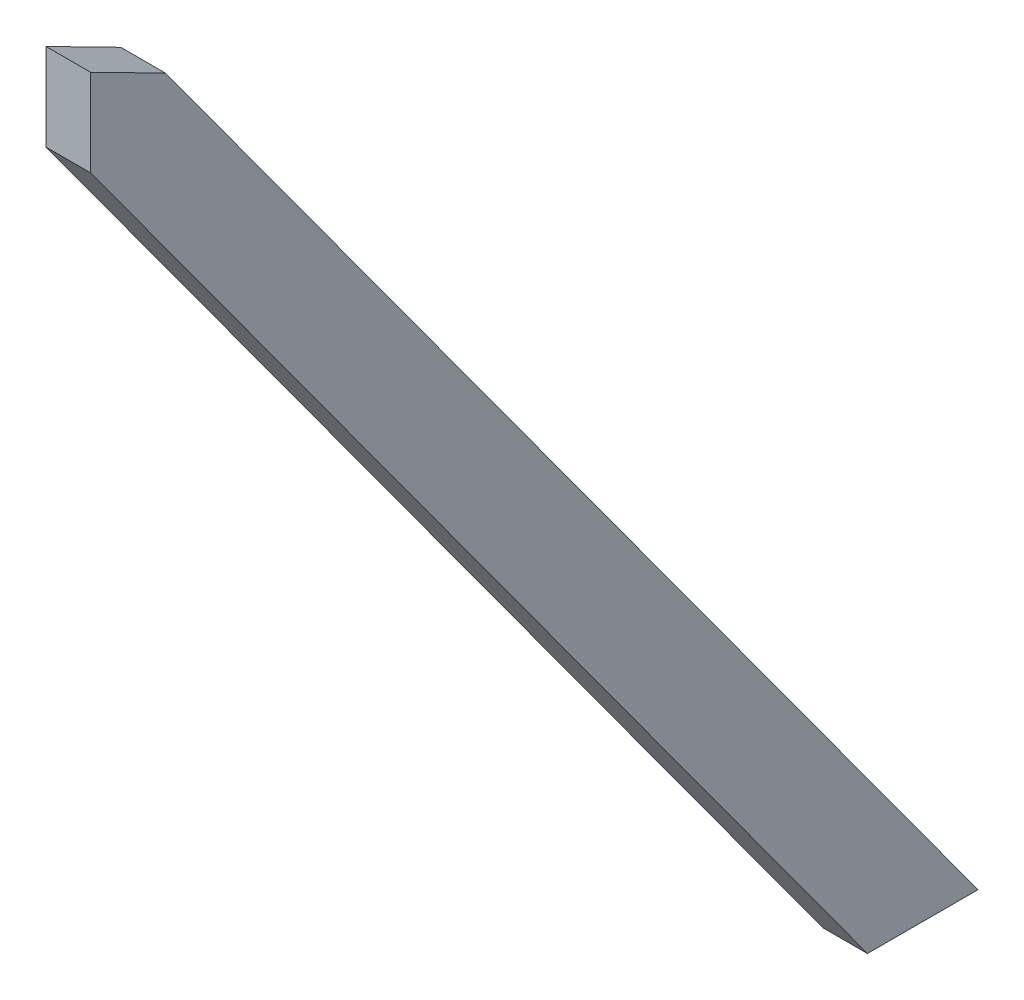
ISO-10303-21;
HEADER;
FILE_DESCRIPTION(('STEP AP214'),'2;1');
FILE_NAME('part.step','',(''),(''),'','','');
FILE_SCHEMA(('AUTOMOTIVE_DESIGN { 1 0 10303 214 1 1 1 1 }'));
ENDSEC;
DATA;
#1=APPLICATION_CONTEXT('core data for automotive mechanical design processes');
#2=APPLICATION_PROTOCOL_DEFINITION('international standard','automotive_design',2000,#1);
#3=PRODUCT_CONTEXT('',#1,'mechanical');
#4=PRODUCT('Part','Part','',(#3));
#5=PRODUCT_RELATED_PRODUCT_CATEGORY('part','',(#4));
#6=PRODUCT_DEFINITION_FORMATION('','',#4);
#7=PRODUCT_DEFINITION_CONTEXT('part definition',#1,'design');
#8=PRODUCT_DEFINITION('design','',#6,#7);
#9=PRODUCT_DEFINITION_SHAPE('','',#8);
#10=(LENGTH_UNIT() NAMED_UNIT(*) SI_UNIT(.MILLI.,.METRE.));
#11=(NAMED_UNIT(*) PLANE_ANGLE_UNIT() SI_UNIT($,.RADIAN.));
#12=(NAMED_UNIT(*) SI_UNIT($,.STERADIAN.) SOLID_ANGLE_UNIT());
#13=UNCERTAINTY_MEASURE_WITH_UNIT(LENGTH_MEASURE(1.E-05),#10,'distance_accuracy_value','');
#14=(GEOMETRIC_REPRESENTATION_CONTEXT(3) GLOBAL_UNCERTAINTY_ASSIGNED_CONTEXT((#13)) GLOBAL_UNIT_ASSIGNED_CONTEXT((#10,
#11,#12)) REPRESENTATION_CONTEXT('',''));
#15=CARTESIAN_POINT('',(0.,0.,0.));
#16=DIRECTION('',(0.,0.,1.));
#17=DIRECTION('',(1.,0.,0.));
#18=AXIS2_PLACEMENT_3D('',#15,#16,#17);
#19=CARTESIAN_POINT('',(5.,-68.3646212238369,-37.1411440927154));
#20=DIRECTION('',(0.,1.,0.));
#21=DIRECTION('',(0.,0.,1.));
#22=AXIS2_PLACEMENT_3D('',#19,#20,#21);
#23=PLANE('',#22);
#24=DIRECTION('',(0.,0.,-1.));
#25=VECTOR('',#24,1.);
#26=CARTESIAN_POINT('',(0.,-68.3646212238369,-37.1411440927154));
#27=LINE('',#26,#25);
#28=CARTESIAN_POINT('',(0.,-68.3646212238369,-37.1411440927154));
#29=VERTEX_POINT('',#28);
#30=CARTESIAN_POINT('',(0.,-68.3646212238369,-49.5206885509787));
#31=VERTEX_POINT('',#30);
#32=EDGE_CURVE('E78',#29,#31,#27,.T.);
#33=ORIENTED_EDGE('',*,*,#32,.T.);
#34=DIRECTION('',(-1.,0.,0.));
#35=VECTOR('',#34,1.);
#36=CARTESIAN_POINT('',(5.,-68.3646212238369,-49.5206885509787));
#37=LINE('',#36,#35);
#38=CARTESIAN_POINT('',(5.,-68.3646212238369,-49.5206885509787));
#39=VERTEX_POINT('',#38);
#40=EDGE_CURVE('E11',#39,#31,#37,.T.);
#41=ORIENTED_EDGE('',*,*,#40,.F.);
#42=DIRECTION('',(0.,0.,-1.));
#43=VECTOR('',#42,1.);
#44=CARTESIAN_POINT('',(5.,-68.3646212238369,-37.1411440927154));
#45=LINE('',#44,#43);
#46=CARTESIAN_POINT('',(5.,-68.3646212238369,-37.1411440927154));
#47=VERTEX_POINT('',#46);
#48=EDGE_CURVE('E99',#47,#39,#45,.T.);
#49=ORIENTED_EDGE('',*,*,#48,.F.);
#50=DIRECTION('',(-1.,0.,0.));
#51=VECTOR('',#50,1.);
#52=CARTESIAN_POINT('',(5.,-68.3646212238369,-37.1411440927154));
#53=LINE('',#52,#51);
#54=EDGE_CURVE('E91',#47,#29,#53,.T.);
#55=ORIENTED_EDGE('',*,*,#54,.T.);
#56=EDGE_LOOP('',(#33,#41,#49,#55));
#57=FACE_BOUND('',#56,.T.);
#58=ADVANCED_FACE('F28',(#57),#23,.F.);
#59=CARTESIAN_POINT('',(5.,-68.3646212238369,-49.5206885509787));
#60=DIRECTION('',(0.,-0.589478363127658,0.807784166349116));
#61=DIRECTION('',(0.,-0.807784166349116,-0.589478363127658));
#62=AXIS2_PLACEMENT_3D('',#59,#60,#61);
#63=PLANE('',#62);
#64=DIRECTION('',(0.,0.807784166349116,0.589478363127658));
#65=VECTOR('',#64,1.);
#66=CARTESIAN_POINT('',(0.,-68.3646212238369,-49.5206885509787));
#67=LINE('',#66,#65);
#68=CARTESIAN_POINT('',(0.,56.3087870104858,41.4594020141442));
#69=VERTEX_POINT('',#68);
#70=EDGE_CURVE('E74',#31,#69,#67,.T.);
#71=ORIENTED_EDGE('',*,*,#70,.T.);
#72=DIRECTION('',(-1.,0.,0.));
#73=VECTOR('',#72,1.);
#74=CARTESIAN_POINT('',(5.,56.3087870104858,41.4594020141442));
#75=LINE('',#74,#73);
#76=CARTESIAN_POINT('',(5.,56.3087870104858,41.4594020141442));
#77=VERTEX_POINT('',#76);
#78=EDGE_CURVE('E35',#77,#69,#75,.T.);
#79=ORIENTED_EDGE('',*,*,#78,.F.);
#80=DIRECTION('',(0.,0.807784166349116,0.589478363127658));
#81=VECTOR('',#80,1.);
#82=CARTESIAN_POINT('',(5.,-68.3646212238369,-49.5206885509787));
#83=LINE('',#82,#81);
#84=EDGE_CURVE('E87',#39,#77,#83,.T.);
#85=ORIENTED_EDGE('',*,*,#84,.F.);
#86=ORIENTED_EDGE('',*,*,#40,.T.);
#87=EDGE_LOOP('',(#71,#79,#85,#86));
#88=FACE_BOUND('',#87,.T.);
#89=ADVANCED_FACE('F86',(#88),#63,.F.);
#90=CARTESIAN_POINT('',(5.,60.5753387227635,49.8329812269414));
#91=DIRECTION('',(0.,-0.891006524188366,0.453990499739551));
#92=DIRECTION('',(0.,-0.453990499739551,-0.891006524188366));
#93=AXIS2_PLACEMENT_3D('',#90,#91,#92);
#94=PLANE('',#93);
#95=DIRECTION('',(0.,0.453990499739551,0.891006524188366));
#96=VECTOR('',#95,1.);
#97=CARTESIAN_POINT('',(0.,60.5753387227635,49.8329812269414));
#98=LINE('',#97,#96);
#99=CARTESIAN_POINT('',(0.,60.5753387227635,49.8329812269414));
#100=VERTEX_POINT('',#99);
#101=EDGE_CURVE('E80',#69,#100,#98,.T.);
#102=ORIENTED_EDGE('',*,*,#101,.T.);
#103=DIRECTION('',(-1.,0.,0.));
#104=VECTOR('',#103,1.);
#105=CARTESIAN_POINT('',(5.,60.5753387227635,49.8329812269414));
#106=LINE('',#105,#104);
#107=CARTESIAN_POINT('',(5.,60.5753387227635,49.8329812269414));
#108=VERTEX_POINT('',#107);
#109=EDGE_CURVE('E110',#108,#100,#106,.T.);
#110=ORIENTED_EDGE('',*,*,#109,.F.);
#111=DIRECTION('',(0.,0.453990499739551,0.891006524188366));
#112=VECTOR('',#111,1.);
#113=CARTESIAN_POINT('',(5.,60.5753387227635,49.8329812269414));
#114=LINE('',#113,#112);
#115=EDGE_CURVE('E102',#77,#108,#114,.T.);
#116=ORIENTED_EDGE('',*,*,#115,.F.);
#117=ORIENTED_EDGE('',*,*,#78,.T.);
#118=EDGE_LOOP('',(#102,#110,#116,#117));
#119=FACE_BOUND('',#118,.T.);
#120=ADVANCED_FACE('F114',(#119),#94,.F.);
#121=CARTESIAN_POINT('',(5.,50.8192635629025,49.8329812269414));
#122=DIRECTION('',(0.,0.,-1.));
#123=DIRECTION('',(-1.,0.,0.));
#124=AXIS2_PLACEMENT_3D('',#121,#122,#123);
#125=PLANE('',#124);
#126=DIRECTION('',(0.,-1.,0.));
#127=VECTOR('',#126,1.);
#128=CARTESIAN_POINT('',(0.,50.8192635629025,49.8329812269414));
#129=LINE('',#128,#127);
#130=CARTESIAN_POINT('',(0.,50.8192635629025,49.8329812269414));
#131=VERTEX_POINT('',#130);
#132=EDGE_CURVE('E95',#100,#131,#129,.T.);
#133=ORIENTED_EDGE('',*,*,#132,.T.);
#134=DIRECTION('',(-1.,0.,0.));
#135=VECTOR('',#134,1.);
#136=CARTESIAN_POINT('',(5.,50.8192635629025,49.8329812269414));
#137=LINE('',#136,#135);
#138=CARTESIAN_POINT('',(5.,50.8192635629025,49.8329812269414));
#139=VERTEX_POINT('',#138);
#140=EDGE_CURVE('E107',#139,#131,#137,.T.);
#141=ORIENTED_EDGE('',*,*,#140,.F.);
#142=DIRECTION('',(0.,-1.,0.));
#143=VECTOR('',#142,1.);
#144=CARTESIAN_POINT('',(5.,50.8192635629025,49.8329812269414));
#145=LINE('',#144,#143);
#146=EDGE_CURVE('E47',#108,#139,#145,.T.);
#147=ORIENTED_EDGE('',*,*,#146,.F.);
#148=ORIENTED_EDGE('',*,*,#109,.T.);
#149=EDGE_LOOP('',(#133,#141,#147,#148));
#150=FACE_BOUND('',#149,.T.);
#151=ADVANCED_FACE('F125',(#150),#125,.F.);
#152=CARTESIAN_POINT('',(5.,-68.3646212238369,-37.1411440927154));
#153=DIRECTION('',(0.,0.589478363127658,-0.807784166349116));
#154=DIRECTION('',(0.,0.807784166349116,0.589478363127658));
#155=AXIS2_PLACEMENT_3D('',#152,#153,#154);
#156=PLANE('',#155);
#157=DIRECTION('',(0.,-0.807784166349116,-0.589478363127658));
#158=VECTOR('',#157,1.);
#159=CARTESIAN_POINT('',(0.,-68.3646212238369,-37.1411440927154));
#160=LINE('',#159,#158);
#161=EDGE_CURVE('E97',#131,#29,#160,.T.);
#162=ORIENTED_EDGE('',*,*,#161,.T.);
#163=ORIENTED_EDGE('',*,*,#54,.F.);
#164=DIRECTION('',(0.,-0.807784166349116,-0.589478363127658));
#165=VECTOR('',#164,1.);
#166=CARTESIAN_POINT('',(5.,-68.3646212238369,-37.1411440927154));
#167=LINE('',#166,#165);
#168=EDGE_CURVE('E42',#139,#47,#167,.T.);
#169=ORIENTED_EDGE('',*,*,#168,.F.);
#170=ORIENTED_EDGE('',*,*,#140,.T.);
#171=EDGE_LOOP('',(#162,#163,#169,#170));
#172=FACE_BOUND('',#171,.T.);
#173=ADVANCED_FACE('F118',(#172),#156,.F.);
#174=CARTESIAN_POINT('',(5.,-68.3646212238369,49.8329812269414));
#175=DIRECTION('',(1.,0.,0.));
#176=DIRECTION('',(0.,0.,-1.));
#177=AXIS2_PLACEMENT_3D('',#174,#175,#176);
#178=PLANE('',#177);
#179=ORIENTED_EDGE('',*,*,#48,.T.);
#180=ORIENTED_EDGE('',*,*,#84,.T.);
#181=ORIENTED_EDGE('',*,*,#115,.T.);
#182=ORIENTED_EDGE('',*,*,#146,.T.);
#183=ORIENTED_EDGE('',*,*,#168,.T.);
#184=EDGE_LOOP('',(#179,#180,#181,#182,#183));
#185=FACE_BOUND('',#184,.T.);
#186=ADVANCED_FACE('F116',(#185),#178,.T.);
#187=CARTESIAN_POINT('',(0.,-68.3646212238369,49.8329812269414));
#188=DIRECTION('',(1.,0.,0.));
#189=DIRECTION('',(0.,0.,-1.));
#190=AXIS2_PLACEMENT_3D('',#187,#188,#189);
#191=PLANE('',#190);
#192=ORIENTED_EDGE('',*,*,#32,.F.);
#193=ORIENTED_EDGE('',*,*,#161,.F.);
#194=ORIENTED_EDGE('',*,*,#132,.F.);
#195=ORIENTED_EDGE('',*,*,#101,.F.);
#196=ORIENTED_EDGE('',*,*,#70,.F.);
#197=EDGE_LOOP('',(#192,#193,#194,#195,#196));
#198=FACE_BOUND('',#197,.T.);
#199=ADVANCED_FACE('F75',(#198),#191,.F.);
#200=CLOSED_SHELL('',(#58,#89,#120,#151,#173,#186,#199));
#201=MANIFOLD_SOLID_BREP('B2',#200);
#202=ADVANCED_BREP_SHAPE_REPRESENTATION('',(#18,#201),#14);
#203=SHAPE_DEFINITION_REPRESENTATION(#9,#202);
ENDSEC;
END-ISO-10303-21;
